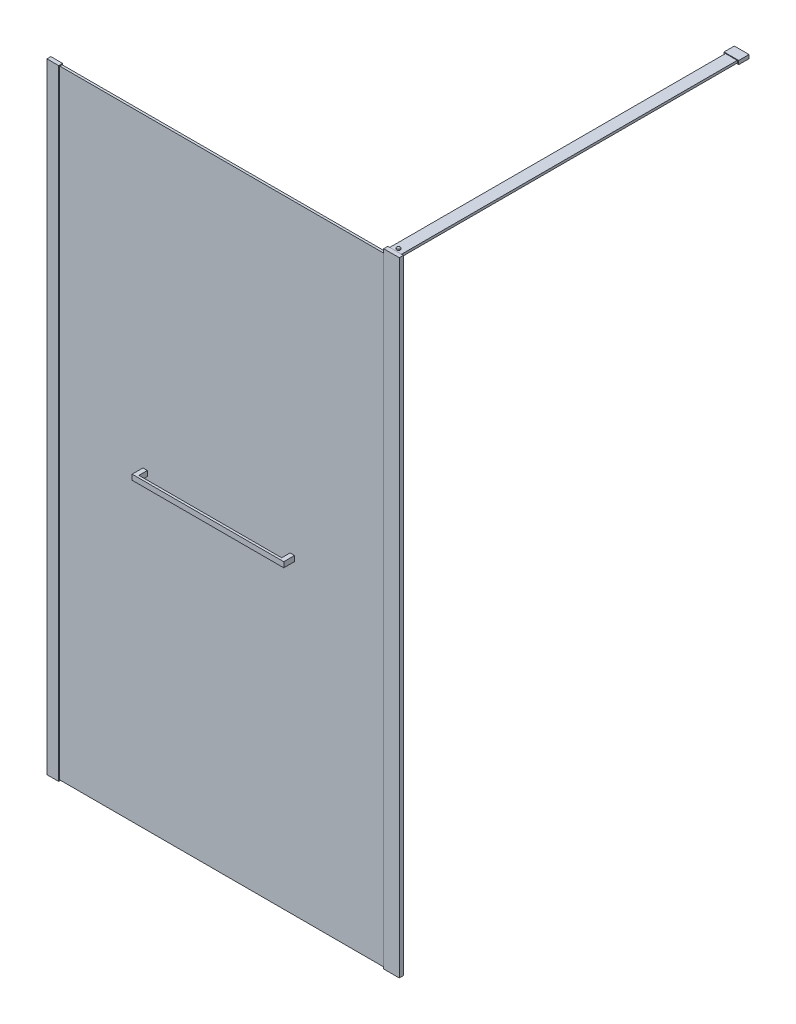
ISO-10303-21;
HEADER;
FILE_DESCRIPTION(('STEP AP214'),'2;1');
FILE_NAME('part.step','',(''),(''),'','','');
FILE_SCHEMA(('AUTOMOTIVE_DESIGN { 1 0 10303 214 1 1 1 1 }'));
ENDSEC;
DATA;
#1=APPLICATION_CONTEXT('core data for automotive mechanical design processes');
#2=APPLICATION_PROTOCOL_DEFINITION('international standard','automotive_design',2000,#1);
#3=PRODUCT_CONTEXT('',#1,'mechanical');
#4=PRODUCT('Part','Part','',(#3));
#5=PRODUCT_RELATED_PRODUCT_CATEGORY('part','',(#4));
#6=PRODUCT_DEFINITION_FORMATION('','',#4);
#7=PRODUCT_DEFINITION_CONTEXT('part definition',#1,'design');
#8=PRODUCT_DEFINITION('design','',#6,#7);
#9=PRODUCT_DEFINITION_SHAPE('','',#8);
#10=(LENGTH_UNIT() NAMED_UNIT(*) SI_UNIT(.MILLI.,.METRE.));
#11=(NAMED_UNIT(*) PLANE_ANGLE_UNIT() SI_UNIT($,.RADIAN.));
#12=(NAMED_UNIT(*) SI_UNIT($,.STERADIAN.) SOLID_ANGLE_UNIT());
#13=UNCERTAINTY_MEASURE_WITH_UNIT(LENGTH_MEASURE(1.E-05),#10,'distance_accuracy_value','');
#14=(GEOMETRIC_REPRESENTATION_CONTEXT(3) GLOBAL_UNCERTAINTY_ASSIGNED_CONTEXT((#13)) GLOBAL_UNIT_ASSIGNED_CONTEXT((#10,
#11,#12)) REPRESENTATION_CONTEXT('',''));
#15=CARTESIAN_POINT('',(0.,0.,0.));
#16=DIRECTION('',(0.,0.,1.));
#17=DIRECTION('',(1.,0.,0.));
#18=AXIS2_PLACEMENT_3D('',#15,#16,#17);
#19=CARTESIAN_POINT('',(337.5,1062.,-21.4));
#20=DIRECTION('',(1.,0.,0.));
#21=DIRECTION('',(0.,0.,-1.));
#22=AXIS2_PLACEMENT_3D('',#19,#20,#21);
#23=PLANE('',#22);
#24=DIRECTION('',(0.,1.,0.));
#25=VECTOR('',#24,1.);
#26=CARTESIAN_POINT('',(337.5,1062.,25.1));
#27=LINE('',#26,#25);
#28=CARTESIAN_POINT('',(337.5,1044.,25.1));
#29=VERTEX_POINT('',#28);
#30=CARTESIAN_POINT('',(337.5,1062.,25.1));
#31=VERTEX_POINT('',#30);
#32=EDGE_CURVE('E63',#29,#31,#27,.T.);
#33=ORIENTED_EDGE('',*,*,#32,.F.);
#34=DIRECTION('',(0.,0.,1.));
#35=VECTOR('',#34,1.);
#36=CARTESIAN_POINT('',(337.5,1044.,-21.4));
#37=LINE('',#36,#35);
#38=CARTESIAN_POINT('',(337.5,1044.,-21.4));
#39=VERTEX_POINT('',#38);
#40=EDGE_CURVE('E12',#39,#29,#37,.T.);
#41=ORIENTED_EDGE('',*,*,#40,.F.);
#42=DIRECTION('',(0.,1.,0.));
#43=VECTOR('',#42,1.);
#44=CARTESIAN_POINT('',(337.5,1062.,-21.4));
#45=LINE('',#44,#43);
#46=CARTESIAN_POINT('',(337.5,1062.,-21.4));
#47=VERTEX_POINT('',#46);
#48=EDGE_CURVE('E193',#39,#47,#45,.T.);
#49=ORIENTED_EDGE('',*,*,#48,.T.);
#50=DIRECTION('',(0.,0.,1.));
#51=VECTOR('',#50,1.);
#52=CARTESIAN_POINT('',(337.5,1062.,-21.4));
#53=LINE('',#52,#51);
#54=EDGE_CURVE('E176',#47,#31,#53,.T.);
#55=ORIENTED_EDGE('',*,*,#54,.T.);
#56=EDGE_LOOP('',(#33,#41,#49,#55));
#57=FACE_BOUND('',#56,.T.);
#58=ADVANCED_FACE('F46',(#57),#23,.T.);
#59=CARTESIAN_POINT('',(322.5,1044.,-21.4));
#60=DIRECTION('',(0.,-1.,0.));
#61=DIRECTION('',(0.,0.,-1.));
#62=AXIS2_PLACEMENT_3D('',#59,#60,#61);
#63=PLANE('',#62);
#64=ORIENTED_EDGE('',*,*,#40,.T.);
#65=DIRECTION('',(-1.,0.,0.));
#66=VECTOR('',#65,1.);
#67=CARTESIAN_POINT('',(842.197715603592,1044.,25.1));
#68=LINE('',#67,#66);
#69=CARTESIAN_POINT('',(822.5,1044.,25.1));
#70=VERTEX_POINT('',#69);
#71=EDGE_CURVE('E166',#70,#29,#68,.T.);
#72=ORIENTED_EDGE('',*,*,#71,.F.);
#73=DIRECTION('',(0.,0.,1.));
#74=VECTOR('',#73,1.);
#75=CARTESIAN_POINT('',(822.5,1044.,-21.4));
#76=LINE('',#75,#74);
#77=CARTESIAN_POINT('',(822.5,1044.,-21.4));
#78=VERTEX_POINT('',#77);
#79=EDGE_CURVE('E149',#78,#70,#76,.T.);
#80=ORIENTED_EDGE('',*,*,#79,.F.);
#81=DIRECTION('',(1.,0.,0.));
#82=VECTOR('',#81,1.);
#83=CARTESIAN_POINT('',(822.5,1044.,-21.4));
#84=LINE('',#83,#82);
#85=CARTESIAN_POINT('',(837.5,1044.,-21.4));
#86=VERTEX_POINT('',#85);
#87=EDGE_CURVE('E131',#78,#86,#84,.T.);
#88=ORIENTED_EDGE('',*,*,#87,.T.);
#89=DIRECTION('',(0.,0.,1.));
#90=VECTOR('',#89,1.);
#91=CARTESIAN_POINT('',(837.5,1044.,-21.4));
#92=LINE('',#91,#90);
#93=CARTESIAN_POINT('',(837.5,1044.,33.1));
#94=VERTEX_POINT('',#93);
#95=EDGE_CURVE('E147',#86,#94,#92,.T.);
#96=ORIENTED_EDGE('',*,*,#95,.T.);
#97=DIRECTION('',(1.,0.,0.));
#98=VECTOR('',#97,1.);
#99=CARTESIAN_POINT('',(322.5,1044.,33.1));
#100=LINE('',#99,#98);
#101=CARTESIAN_POINT('',(322.5,1044.,33.1));
#102=VERTEX_POINT('',#101);
#103=EDGE_CURVE('E135',#102,#94,#100,.T.);
#104=ORIENTED_EDGE('',*,*,#103,.F.);
#105=DIRECTION('',(0.,0.,1.));
#106=VECTOR('',#105,1.);
#107=CARTESIAN_POINT('',(322.5,1044.,-21.4));
#108=LINE('',#107,#106);
#109=CARTESIAN_POINT('',(322.5,1044.,-21.4));
#110=VERTEX_POINT('',#109);
#111=EDGE_CURVE('E55',#110,#102,#108,.T.);
#112=ORIENTED_EDGE('',*,*,#111,.F.);
#113=DIRECTION('',(1.,0.,0.));
#114=VECTOR('',#113,1.);
#115=CARTESIAN_POINT('',(322.5,1044.,-21.4));
#116=LINE('',#115,#114);
#117=EDGE_CURVE('E181',#110,#39,#116,.T.);
#118=ORIENTED_EDGE('',*,*,#117,.T.);
#119=EDGE_LOOP('',(#64,#72,#80,#88,#96,#104,#112,#118));
#120=FACE_BOUND('',#119,.T.);
#121=ADVANCED_FACE('F197',(#120),#63,.T.);
#122=CARTESIAN_POINT('',(322.5,1062.,-21.4));
#123=DIRECTION('',(-1.,0.,0.));
#124=DIRECTION('',(0.,0.,1.));
#125=AXIS2_PLACEMENT_3D('',#122,#123,#124);
#126=PLANE('',#125);
#127=ORIENTED_EDGE('',*,*,#111,.T.);
#128=DIRECTION('',(0.,-1.,0.));
#129=VECTOR('',#128,1.);
#130=CARTESIAN_POINT('',(322.5,1062.,33.1));
#131=LINE('',#130,#129);
#132=CARTESIAN_POINT('',(322.5,1062.,33.1));
#133=VERTEX_POINT('',#132);
#134=EDGE_CURVE('E121',#133,#102,#131,.T.);
#135=ORIENTED_EDGE('',*,*,#134,.F.);
#136=DIRECTION('',(0.,0.,1.));
#137=VECTOR('',#136,1.);
#138=CARTESIAN_POINT('',(322.5,1062.,-21.4));
#139=LINE('',#138,#137);
#140=CARTESIAN_POINT('',(322.5,1062.,-21.4));
#141=VERTEX_POINT('',#140);
#142=EDGE_CURVE('E116',#141,#133,#139,.T.);
#143=ORIENTED_EDGE('',*,*,#142,.F.);
#144=DIRECTION('',(0.,-1.,0.));
#145=VECTOR('',#144,1.);
#146=CARTESIAN_POINT('',(322.5,1062.,-21.4));
#147=LINE('',#146,#145);
#148=EDGE_CURVE('E186',#141,#110,#147,.T.);
#149=ORIENTED_EDGE('',*,*,#148,.T.);
#150=EDGE_LOOP('',(#127,#135,#143,#149));
#151=FACE_BOUND('',#150,.T.);
#152=ADVANCED_FACE('F218',(#151),#126,.T.);
#153=CARTESIAN_POINT('',(322.5,1062.,-21.4));
#154=DIRECTION('',(0.,1.,0.));
#155=DIRECTION('',(0.,0.,1.));
#156=AXIS2_PLACEMENT_3D('',#153,#154,#155);
#157=PLANE('',#156);
#158=ORIENTED_EDGE('',*,*,#142,.T.);
#159=DIRECTION('',(-1.,0.,0.));
#160=VECTOR('',#159,1.);
#161=CARTESIAN_POINT('',(322.5,1062.,33.1));
#162=LINE('',#161,#160);
#163=CARTESIAN_POINT('',(837.5,1062.,33.1));
#164=VERTEX_POINT('',#163);
#165=EDGE_CURVE('E109',#164,#133,#162,.T.);
#166=ORIENTED_EDGE('',*,*,#165,.F.);
#167=DIRECTION('',(0.,0.,1.));
#168=VECTOR('',#167,1.);
#169=CARTESIAN_POINT('',(837.5,1062.,-21.4));
#170=LINE('',#169,#168);
#171=CARTESIAN_POINT('',(837.5,1062.,-21.4));
#172=VERTEX_POINT('',#171);
#173=EDGE_CURVE('E113',#172,#164,#170,.T.);
#174=ORIENTED_EDGE('',*,*,#173,.F.);
#175=DIRECTION('',(-1.,0.,0.));
#176=VECTOR('',#175,1.);
#177=CARTESIAN_POINT('',(822.5,1062.,-21.4));
#178=LINE('',#177,#176);
#179=CARTESIAN_POINT('',(822.5,1062.,-21.4));
#180=VERTEX_POINT('',#179);
#181=EDGE_CURVE('E138',#172,#180,#178,.T.);
#182=ORIENTED_EDGE('',*,*,#181,.T.);
#183=DIRECTION('',(0.,0.,1.));
#184=VECTOR('',#183,1.);
#185=CARTESIAN_POINT('',(822.5,1062.,-21.4));
#186=LINE('',#185,#184);
#187=CARTESIAN_POINT('',(822.5,1062.,25.1));
#188=VERTEX_POINT('',#187);
#189=EDGE_CURVE('E130',#180,#188,#186,.T.);
#190=ORIENTED_EDGE('',*,*,#189,.T.);
#191=DIRECTION('',(-1.,0.,0.));
#192=VECTOR('',#191,1.);
#193=CARTESIAN_POINT('',(842.197715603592,1062.,25.1));
#194=LINE('',#193,#192);
#195=EDGE_CURVE('E163',#188,#31,#194,.T.);
#196=ORIENTED_EDGE('',*,*,#195,.T.);
#197=ORIENTED_EDGE('',*,*,#54,.F.);
#198=DIRECTION('',(-1.,0.,0.));
#199=VECTOR('',#198,1.);
#200=CARTESIAN_POINT('',(322.5,1062.,-21.4));
#201=LINE('',#200,#199);
#202=EDGE_CURVE('E190',#47,#141,#201,.T.);
#203=ORIENTED_EDGE('',*,*,#202,.T.);
#204=EDGE_LOOP('',(#158,#166,#174,#182,#190,#196,#197,#203));
#205=FACE_BOUND('',#204,.T.);
#206=ADVANCED_FACE('F111',(#205),#157,.T.);
#207=CARTESIAN_POINT('',(337.5,1044.,-21.4));
#208=DIRECTION('',(0.,0.,1.));
#209=DIRECTION('',(1.,0.,0.));
#210=AXIS2_PLACEMENT_3D('',#207,#208,#209);
#211=PLANE('',#210);
#212=ORIENTED_EDGE('',*,*,#48,.F.);
#213=ORIENTED_EDGE('',*,*,#117,.F.);
#214=ORIENTED_EDGE('',*,*,#148,.F.);
#215=ORIENTED_EDGE('',*,*,#202,.F.);
#216=EDGE_LOOP('',(#212,#213,#214,#215));
#217=FACE_BOUND('',#216,.T.);
#218=ADVANCED_FACE('F225',(#217),#211,.F.);
#219=CARTESIAN_POINT('',(337.5,1044.,33.1));
#220=DIRECTION('',(0.,0.,1.));
#221=DIRECTION('',(1.,0.,0.));
#222=AXIS2_PLACEMENT_3D('',#219,#220,#221);
#223=PLANE('',#222);
#224=ORIENTED_EDGE('',*,*,#103,.T.);
#225=DIRECTION('',(0.,1.,0.));
#226=VECTOR('',#225,1.);
#227=CARTESIAN_POINT('',(837.5,1062.,33.1));
#228=LINE('',#227,#226);
#229=EDGE_CURVE('E127',#94,#164,#228,.T.);
#230=ORIENTED_EDGE('',*,*,#229,.T.);
#231=ORIENTED_EDGE('',*,*,#165,.T.);
#232=ORIENTED_EDGE('',*,*,#134,.T.);
#233=EDGE_LOOP('',(#224,#230,#231,#232));
#234=FACE_BOUND('',#233,.T.);
#235=ADVANCED_FACE('F133',(#234),#223,.T.);
#236=CARTESIAN_POINT('',(842.197715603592,1062.,25.1));
#237=DIRECTION('',(0.,0.,1.));
#238=DIRECTION('',(1.,0.,0.));
#239=AXIS2_PLACEMENT_3D('',#236,#237,#238);
#240=PLANE('',#239);
#241=ORIENTED_EDGE('',*,*,#195,.F.);
#242=DIRECTION('',(0.,-1.,0.));
#243=VECTOR('',#242,1.);
#244=CARTESIAN_POINT('',(822.5,1062.,25.1));
#245=LINE('',#244,#243);
#246=EDGE_CURVE('E49',#188,#70,#245,.T.);
#247=ORIENTED_EDGE('',*,*,#246,.T.);
#248=ORIENTED_EDGE('',*,*,#71,.T.);
#249=ORIENTED_EDGE('',*,*,#32,.T.);
#250=EDGE_LOOP('',(#241,#247,#248,#249));
#251=FACE_BOUND('',#250,.T.);
#252=ADVANCED_FACE('F203',(#251),#240,.F.);
#253=CARTESIAN_POINT('',(822.5,1062.,-21.4));
#254=DIRECTION('',(-1.,0.,0.));
#255=DIRECTION('',(0.,0.,1.));
#256=AXIS2_PLACEMENT_3D('',#253,#254,#255);
#257=PLANE('',#256);
#258=ORIENTED_EDGE('',*,*,#246,.F.);
#259=ORIENTED_EDGE('',*,*,#189,.F.);
#260=DIRECTION('',(0.,-1.,0.));
#261=VECTOR('',#260,1.);
#262=CARTESIAN_POINT('',(822.5,1062.,-21.4));
#263=LINE('',#262,#261);
#264=EDGE_CURVE('E142',#180,#78,#263,.T.);
#265=ORIENTED_EDGE('',*,*,#264,.T.);
#266=ORIENTED_EDGE('',*,*,#79,.T.);
#267=EDGE_LOOP('',(#258,#259,#265,#266));
#268=FACE_BOUND('',#267,.T.);
#269=ADVANCED_FACE('F204',(#268),#257,.T.);
#270=CARTESIAN_POINT('',(837.5,1062.,-21.4));
#271=DIRECTION('',(1.,0.,0.));
#272=DIRECTION('',(0.,0.,-1.));
#273=AXIS2_PLACEMENT_3D('',#270,#271,#272);
#274=PLANE('',#273);
#275=ORIENTED_EDGE('',*,*,#173,.T.);
#276=ORIENTED_EDGE('',*,*,#229,.F.);
#277=ORIENTED_EDGE('',*,*,#95,.F.);
#278=DIRECTION('',(0.,1.,0.));
#279=VECTOR('',#278,1.);
#280=CARTESIAN_POINT('',(837.5,1062.,-21.4));
#281=LINE('',#280,#279);
#282=EDGE_CURVE('E129',#86,#172,#281,.T.);
#283=ORIENTED_EDGE('',*,*,#282,.T.);
#284=EDGE_LOOP('',(#275,#276,#277,#283));
#285=FACE_BOUND('',#284,.T.);
#286=ADVANCED_FACE('F126',(#285),#274,.T.);
#287=CARTESIAN_POINT('',(837.5,1044.,-21.4));
#288=DIRECTION('',(0.,0.,1.));
#289=DIRECTION('',(1.,0.,0.));
#290=AXIS2_PLACEMENT_3D('',#287,#288,#289);
#291=PLANE('',#290);
#292=ORIENTED_EDGE('',*,*,#282,.F.);
#293=ORIENTED_EDGE('',*,*,#87,.F.);
#294=ORIENTED_EDGE('',*,*,#264,.F.);
#295=ORIENTED_EDGE('',*,*,#181,.F.);
#296=EDGE_LOOP('',(#292,#293,#294,#295));
#297=FACE_BOUND('',#296,.T.);
#298=ADVANCED_FACE('F200',(#297),#291,.F.);
#299=CLOSED_SHELL('',(#58,#121,#152,#206,#218,#235,#252,#269,#286,#298));
#300=MANIFOLD_SOLID_BREP('B2',#299);
#301=CARTESIAN_POINT('',(1189.9,2119.,-1184.4));
#302=DIRECTION('',(-1.,0.,0.));
#303=DIRECTION('',(0.,0.,1.));
#304=AXIS2_PLACEMENT_3D('',#301,#302,#303);
#305=PLANE('',#304);
#306=DIRECTION('',(0.,-1.,0.));
#307=VECTOR('',#306,1.);
#308=CARTESIAN_POINT('',(1189.9,2119.,-1155.));
#309=LINE('',#308,#307);
#310=CARTESIAN_POINT('',(1189.9,2119.,-1155.));
#311=VERTEX_POINT('',#310);
#312=CARTESIAN_POINT('',(1189.9,2111.,-1155.));
#313=VERTEX_POINT('',#312);
#314=EDGE_CURVE('E417',#311,#313,#309,.T.);
#315=ORIENTED_EDGE('',*,*,#314,.F.);
#316=DIRECTION('',(0.,0.,1.));
#317=VECTOR('',#316,1.);
#318=CARTESIAN_POINT('',(1189.9,2119.,-1184.4));
#319=LINE('',#318,#317);
#320=CARTESIAN_POINT('',(1189.9,2119.,-14.4));
#321=VERTEX_POINT('',#320);
#322=EDGE_CURVE('E432',#311,#321,#319,.T.);
#323=ORIENTED_EDGE('',*,*,#322,.T.);
#324=DIRECTION('',(0.,-1.,0.));
#325=VECTOR('',#324,1.);
#326=CARTESIAN_POINT('',(1189.9,2119.,-14.4));
#327=LINE('',#326,#325);
#328=CARTESIAN_POINT('',(1189.9,2111.,-14.4));
#329=VERTEX_POINT('',#328);
#330=EDGE_CURVE('E420',#321,#329,#327,.T.);
#331=ORIENTED_EDGE('',*,*,#330,.T.);
#332=DIRECTION('',(0.,0.,1.));
#333=VECTOR('',#332,1.);
#334=CARTESIAN_POINT('',(1189.9,2111.,-1184.4));
#335=LINE('',#334,#333);
#336=EDGE_CURVE('E327',#313,#329,#335,.T.);
#337=ORIENTED_EDGE('',*,*,#336,.F.);
#338=EDGE_LOOP('',(#315,#323,#331,#337));
#339=FACE_BOUND('',#338,.T.);
#340=ADVANCED_FACE('F319',(#339),#305,.F.);
#341=CARTESIAN_POINT('',(1189.9,2111.,-1184.4));
#342=DIRECTION('',(0.,1.,0.));
#343=DIRECTION('',(0.,0.,1.));
#344=AXIS2_PLACEMENT_3D('',#341,#342,#343);
#345=PLANE('',#344);
#346=DIRECTION('',(-1.,0.,0.));
#347=VECTOR('',#346,1.);
#348=CARTESIAN_POINT('',(1189.9,2111.,-1155.));
#349=LINE('',#348,#347);
#350=CARTESIAN_POINT('',(1149.9,2111.,-1155.));
#351=VERTEX_POINT('',#350);
#352=EDGE_CURVE('E334',#313,#351,#349,.T.);
#353=ORIENTED_EDGE('',*,*,#352,.F.);
#354=ORIENTED_EDGE('',*,*,#336,.T.);
#355=DIRECTION('',(-1.,0.,0.));
#356=VECTOR('',#355,1.);
#357=CARTESIAN_POINT('',(1189.9,2111.,-14.4));
#358=LINE('',#357,#356);
#359=CARTESIAN_POINT('',(1149.9,2111.,-14.4));
#360=VERTEX_POINT('',#359);
#361=EDGE_CURVE('E423',#329,#360,#358,.T.);
#362=ORIENTED_EDGE('',*,*,#361,.T.);
#363=DIRECTION('',(0.,0.,1.));
#364=VECTOR('',#363,1.);
#365=CARTESIAN_POINT('',(1149.9,2111.,-1184.4));
#366=LINE('',#365,#364);
#367=EDGE_CURVE('E436',#351,#360,#366,.T.);
#368=ORIENTED_EDGE('',*,*,#367,.F.);
#369=EDGE_LOOP('',(#353,#354,#362,#368));
#370=FACE_BOUND('',#369,.T.);
#371=ADVANCED_FACE('F438',(#370),#345,.F.);
#372=CARTESIAN_POINT('',(1149.9,2119.,-1184.4));
#373=DIRECTION('',(1.,0.,0.));
#374=DIRECTION('',(0.,0.,-1.));
#375=AXIS2_PLACEMENT_3D('',#372,#373,#374);
#376=PLANE('',#375);
#377=DIRECTION('',(0.,1.,0.));
#378=VECTOR('',#377,1.);
#379=CARTESIAN_POINT('',(1149.9,2119.,-1155.));
#380=LINE('',#379,#378);
#381=CARTESIAN_POINT('',(1149.9,2119.,-1155.));
#382=VERTEX_POINT('',#381);
#383=EDGE_CURVE('E342',#351,#382,#380,.T.);
#384=ORIENTED_EDGE('',*,*,#383,.F.);
#385=ORIENTED_EDGE('',*,*,#367,.T.);
#386=DIRECTION('',(0.,1.,0.));
#387=VECTOR('',#386,1.);
#388=CARTESIAN_POINT('',(1149.9,2119.,-14.4));
#389=LINE('',#388,#387);
#390=CARTESIAN_POINT('',(1149.9,2119.,-14.4));
#391=VERTEX_POINT('',#390);
#392=EDGE_CURVE('E426',#360,#391,#389,.T.);
#393=ORIENTED_EDGE('',*,*,#392,.T.);
#394=DIRECTION('',(0.,0.,1.));
#395=VECTOR('',#394,1.);
#396=CARTESIAN_POINT('',(1149.9,2119.,-1184.4));
#397=LINE('',#396,#395);
#398=EDGE_CURVE('E434',#382,#391,#397,.T.);
#399=ORIENTED_EDGE('',*,*,#398,.F.);
#400=EDGE_LOOP('',(#384,#385,#393,#399));
#401=FACE_BOUND('',#400,.T.);
#402=ADVANCED_FACE('F448',(#401),#376,.F.);
#403=CARTESIAN_POINT('',(1189.9,2119.,-1184.4));
#404=DIRECTION('',(0.,-1.,0.));
#405=DIRECTION('',(0.,0.,-1.));
#406=AXIS2_PLACEMENT_3D('',#403,#404,#405);
#407=PLANE('',#406);
#408=CARTESIAN_POINT('',(1169.9,2119.,-24.3999999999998));
#409=DIRECTION('',(0.,-1.,0.));
#410=DIRECTION('',(0.,0.,-1.));
#411=AXIS2_PLACEMENT_3D('',#408,#409,#410);
#412=CIRCLE('',#411,5.90000000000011);
#413=CARTESIAN_POINT('',(1169.9,2119.,-30.2999999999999));
#414=VERTEX_POINT('',#413);
#415=EDGE_CURVE('E511',#414,#414,#412,.T.);
#416=ORIENTED_EDGE('',*,*,#415,.T.);
#417=EDGE_LOOP('',(#416));
#418=FACE_BOUND('',#417,.T.);
#419=DIRECTION('',(1.,0.,0.));
#420=VECTOR('',#419,1.);
#421=CARTESIAN_POINT('',(1189.9,2119.,-1155.));
#422=LINE('',#421,#420);
#423=EDGE_CURVE('E44',#382,#311,#422,.T.);
#424=ORIENTED_EDGE('',*,*,#423,.F.);
#425=ORIENTED_EDGE('',*,*,#398,.T.);
#426=DIRECTION('',(1.,0.,0.));
#427=VECTOR('',#426,1.);
#428=CARTESIAN_POINT('',(1189.9,2119.,-14.4));
#429=LINE('',#428,#427);
#430=EDGE_CURVE('E429',#391,#321,#429,.T.);
#431=ORIENTED_EDGE('',*,*,#430,.T.);
#432=ORIENTED_EDGE('',*,*,#322,.F.);
#433=EDGE_LOOP('',(#424,#425,#431,#432));
#434=FACE_BOUND('',#433,.T.);
#435=ADVANCED_FACE('F447',(#418,#434),#407,.F.);
#436=CARTESIAN_POINT('',(1189.9,2111.,-14.4));
#437=DIRECTION('',(0.,0.,-1.));
#438=DIRECTION('',(-1.,0.,0.));
#439=AXIS2_PLACEMENT_3D('',#436,#437,#438);
#440=PLANE('',#439);
#441=ORIENTED_EDGE('',*,*,#330,.F.);
#442=ORIENTED_EDGE('',*,*,#430,.F.);
#443=ORIENTED_EDGE('',*,*,#392,.F.);
#444=ORIENTED_EDGE('',*,*,#361,.F.);
#445=EDGE_LOOP('',(#441,#442,#443,#444));
#446=FACE_BOUND('',#445,.T.);
#447=ADVANCED_FACE('F444',(#446),#440,.F.);
#448=CARTESIAN_POINT('',(1144.9,2108.75,-1155.));
#449=DIRECTION('',(0.,0.,-1.));
#450=DIRECTION('',(-1.,0.,0.));
#451=AXIS2_PLACEMENT_3D('',#448,#449,#450);
#452=PLANE('',#451);
#453=DIRECTION('',(0.,1.,0.));
#454=VECTOR('',#453,1.);
#455=CARTESIAN_POINT('',(1144.9,2121.25,-1155.));
#456=LINE('',#455,#454);
#457=CARTESIAN_POINT('',(1144.9,2108.75,-1155.));
#458=VERTEX_POINT('',#457);
#459=CARTESIAN_POINT('',(1144.9,2121.25,-1155.));
#460=VERTEX_POINT('',#459);
#461=EDGE_CURVE('E409',#458,#460,#456,.T.);
#462=ORIENTED_EDGE('',*,*,#461,.F.);
#463=DIRECTION('',(-1.,0.,0.));
#464=VECTOR('',#463,1.);
#465=CARTESIAN_POINT('',(1194.9,2108.75,-1155.));
#466=LINE('',#465,#464);
#467=CARTESIAN_POINT('',(1194.9,2108.75,-1155.));
#468=VERTEX_POINT('',#467);
#469=EDGE_CURVE('E405',#468,#458,#466,.T.);
#470=ORIENTED_EDGE('',*,*,#469,.F.);
#471=DIRECTION('',(0.,-1.,0.));
#472=VECTOR('',#471,1.);
#473=CARTESIAN_POINT('',(1194.9,2121.25,-1155.));
#474=LINE('',#473,#472);
#475=CARTESIAN_POINT('',(1194.9,2121.25,-1155.));
#476=VERTEX_POINT('',#475);
#477=EDGE_CURVE('E492',#476,#468,#474,.T.);
#478=ORIENTED_EDGE('',*,*,#477,.F.);
#479=DIRECTION('',(1.,0.,0.));
#480=VECTOR('',#479,1.);
#481=CARTESIAN_POINT('',(1194.9,2121.25,-1155.));
#482=LINE('',#481,#480);
#483=EDGE_CURVE('E495',#460,#476,#482,.T.);
#484=ORIENTED_EDGE('',*,*,#483,.F.);
#485=EDGE_LOOP('',(#462,#470,#478,#484));
#486=FACE_BOUND('',#485,.T.);
#487=ORIENTED_EDGE('',*,*,#423,.T.);
#488=ORIENTED_EDGE('',*,*,#314,.T.);
#489=ORIENTED_EDGE('',*,*,#352,.T.);
#490=ORIENTED_EDGE('',*,*,#383,.T.);
#491=EDGE_LOOP('',(#487,#488,#489,#490));
#492=FACE_BOUND('',#491,.T.);
#493=ADVANCED_FACE('F450',(#486,#492),#452,.F.);
#494=CARTESIAN_POINT('',(1144.9,2121.25,-1190.));
#495=DIRECTION('',(1.,0.,0.));
#496=DIRECTION('',(0.,0.,-1.));
#497=AXIS2_PLACEMENT_3D('',#494,#495,#496);
#498=PLANE('',#497);
#499=ORIENTED_EDGE('',*,*,#461,.T.);
#500=DIRECTION('',(0.,0.,1.));
#501=VECTOR('',#500,1.);
#502=CARTESIAN_POINT('',(1144.9,2121.25,-1190.));
#503=LINE('',#502,#501);
#504=CARTESIAN_POINT('',(1144.9,2121.25,-1190.));
#505=VERTEX_POINT('',#504);
#506=EDGE_CURVE('E389',#505,#460,#503,.T.);
#507=ORIENTED_EDGE('',*,*,#506,.F.);
#508=DIRECTION('',(0.,1.,0.));
#509=VECTOR('',#508,1.);
#510=CARTESIAN_POINT('',(1144.9,2121.25,-1190.));
#511=LINE('',#510,#509);
#512=CARTESIAN_POINT('',(1144.9,2108.75,-1190.));
#513=VERTEX_POINT('',#512);
#514=EDGE_CURVE('E396',#513,#505,#511,.T.);
#515=ORIENTED_EDGE('',*,*,#514,.F.);
#516=DIRECTION('',(0.,0.,1.));
#517=VECTOR('',#516,1.);
#518=CARTESIAN_POINT('',(1144.9,2108.75,-1190.));
#519=LINE('',#518,#517);
#520=EDGE_CURVE('E489',#513,#458,#519,.T.);
#521=ORIENTED_EDGE('',*,*,#520,.T.);
#522=EDGE_LOOP('',(#499,#507,#515,#521));
#523=FACE_BOUND('',#522,.T.);
#524=ADVANCED_FACE('F407',(#523),#498,.F.);
#525=CARTESIAN_POINT('',(1194.9,2121.25,-1190.));
#526=DIRECTION('',(0.,-1.,0.));
#527=DIRECTION('',(0.,0.,-1.));
#528=AXIS2_PLACEMENT_3D('',#525,#526,#527);
#529=PLANE('',#528);
#530=ORIENTED_EDGE('',*,*,#483,.T.);
#531=DIRECTION('',(0.,0.,1.));
#532=VECTOR('',#531,1.);
#533=CARTESIAN_POINT('',(1194.9,2121.25,-1190.));
#534=LINE('',#533,#532);
#535=CARTESIAN_POINT('',(1194.9,2121.25,-1190.));
#536=VERTEX_POINT('',#535);
#537=EDGE_CURVE('E392',#536,#476,#534,.T.);
#538=ORIENTED_EDGE('',*,*,#537,.F.);
#539=DIRECTION('',(1.,0.,0.));
#540=VECTOR('',#539,1.);
#541=CARTESIAN_POINT('',(1194.9,2121.25,-1190.));
#542=LINE('',#541,#540);
#543=EDGE_CURVE('E385',#505,#536,#542,.T.);
#544=ORIENTED_EDGE('',*,*,#543,.F.);
#545=ORIENTED_EDGE('',*,*,#506,.T.);
#546=EDGE_LOOP('',(#530,#538,#544,#545));
#547=FACE_BOUND('',#546,.T.);
#548=ADVANCED_FACE('F387',(#547),#529,.F.);
#549=CARTESIAN_POINT('',(1194.9,2121.25,-1190.));
#550=DIRECTION('',(-1.,0.,0.));
#551=DIRECTION('',(0.,0.,1.));
#552=AXIS2_PLACEMENT_3D('',#549,#550,#551);
#553=PLANE('',#552);
#554=ORIENTED_EDGE('',*,*,#477,.T.);
#555=DIRECTION('',(0.,0.,1.));
#556=VECTOR('',#555,1.);
#557=CARTESIAN_POINT('',(1194.9,2108.75,-1190.));
#558=LINE('',#557,#556);
#559=CARTESIAN_POINT('',(1194.9,2108.75,-1190.));
#560=VERTEX_POINT('',#559);
#561=EDGE_CURVE('E412',#560,#468,#558,.T.);
#562=ORIENTED_EDGE('',*,*,#561,.F.);
#563=DIRECTION('',(0.,-1.,0.));
#564=VECTOR('',#563,1.);
#565=CARTESIAN_POINT('',(1194.9,2121.25,-1190.));
#566=LINE('',#565,#564);
#567=EDGE_CURVE('E395',#536,#560,#566,.T.);
#568=ORIENTED_EDGE('',*,*,#567,.F.);
#569=ORIENTED_EDGE('',*,*,#537,.T.);
#570=EDGE_LOOP('',(#554,#562,#568,#569));
#571=FACE_BOUND('',#570,.T.);
#572=ADVANCED_FACE('F477',(#571),#553,.F.);
#573=CARTESIAN_POINT('',(1194.9,2108.75,-1190.));
#574=DIRECTION('',(0.,1.,0.));
#575=DIRECTION('',(0.,0.,1.));
#576=AXIS2_PLACEMENT_3D('',#573,#574,#575);
#577=PLANE('',#576);
#578=ORIENTED_EDGE('',*,*,#469,.T.);
#579=ORIENTED_EDGE('',*,*,#520,.F.);
#580=DIRECTION('',(-1.,0.,0.));
#581=VECTOR('',#580,1.);
#582=CARTESIAN_POINT('',(1194.9,2108.75,-1190.));
#583=LINE('',#582,#581);
#584=EDGE_CURVE('E401',#560,#513,#583,.T.);
#585=ORIENTED_EDGE('',*,*,#584,.F.);
#586=ORIENTED_EDGE('',*,*,#561,.T.);
#587=EDGE_LOOP('',(#578,#579,#585,#586));
#588=FACE_BOUND('',#587,.T.);
#589=ADVANCED_FACE('F479',(#588),#577,.F.);
#590=CARTESIAN_POINT('',(1144.9,2108.75,-1190.));
#591=DIRECTION('',(0.,0.,-1.));
#592=DIRECTION('',(-1.,0.,0.));
#593=AXIS2_PLACEMENT_3D('',#590,#591,#592);
#594=PLANE('',#593);
#595=ORIENTED_EDGE('',*,*,#514,.T.);
#596=ORIENTED_EDGE('',*,*,#543,.T.);
#597=ORIENTED_EDGE('',*,*,#567,.T.);
#598=ORIENTED_EDGE('',*,*,#584,.T.);
#599=EDGE_LOOP('',(#595,#596,#597,#598));
#600=FACE_BOUND('',#599,.T.);
#601=ADVANCED_FACE('F399',(#600),#594,.T.);
#602=CARTESIAN_POINT('',(1169.9,2115.34934210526,-24.3999999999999));
#603=DIRECTION('',(0.,-1.,0.));
#604=DIRECTION('',(0.,0.,-1.));
#605=AXIS2_PLACEMENT_3D('',#602,#603,#604);
#606=SPHERICAL_SURFACE('',#605,9.35065789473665);
#607=CARTESIAN_POINT('',(1169.9,2122.8,-24.3999999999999));
#608=DIRECTION('',(0.,-1.,0.));
#609=DIRECTION('',(0.,0.,-1.));
#610=AXIS2_PLACEMENT_3D('',#607,#608,#609);
#611=CIRCLE('',#610,5.65000000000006);
#612=CARTESIAN_POINT('',(1169.9,2122.8,-30.0499999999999));
#613=VERTEX_POINT('',#612);
#614=EDGE_CURVE('E508',#613,#613,#611,.T.);
#615=ORIENTED_EDGE('',*,*,#614,.F.);
#616=EDGE_LOOP('',(#615));
#617=FACE_BOUND('',#616,.T.);
#618=ADVANCED_FACE('F486',(#617),#606,.T.);
#619=CARTESIAN_POINT('',(1169.9,2119.,-24.3999999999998));
#620=DIRECTION('',(0.,-1.,0.));
#621=DIRECTION('',(0.,0.,-1.));
#622=AXIS2_PLACEMENT_3D('',#619,#620,#621);
#623=CONICAL_SURFACE('',#622,5.90000000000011,0.0656948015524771);
#624=ORIENTED_EDGE('',*,*,#614,.T.);
#625=EDGE_LOOP('',(#624));
#626=FACE_BOUND('',#625,.T.);
#627=ORIENTED_EDGE('',*,*,#415,.F.);
#628=EDGE_LOOP('',(#627));
#629=FACE_BOUND('',#628,.T.);
#630=ADVANCED_FACE('F515',(#626,#629),#623,.T.);
#631=CLOSED_SHELL('',(#340,#371,#402,#435,#447,#493,#524,#548,#572,#589,#601,#618,#630));
#632=CARTESIAN_POINT('',(1169.9,2122.53567623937,-24.3999999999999));
#633=DIRECTION('',(0.,-1.,0.));
#634=DIRECTION('',(0.,0.,-1.));
#635=AXIS2_PLACEMENT_3D('',#632,#633,#634);
#636=CONICAL_SURFACE('',#635,5.1663088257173,0.0656948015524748);
#637=CARTESIAN_POINT('',(1169.9,2119.,-24.3999999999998));
#638=DIRECTION('',(0.,-1.,0.));
#639=DIRECTION('',(0.,0.,-1.));
#640=AXIS2_PLACEMENT_3D('',#637,#638,#639);
#641=CIRCLE('',#640,5.398919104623);
#642=CARTESIAN_POINT('',(1169.9,2119.,-29.7989191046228));
#643=VERTEX_POINT('',#642);
#644=EDGE_CURVE('E496',#643,#643,#641,.T.);
#645=ORIENTED_EDGE('',*,*,#644,.T.);
#646=EDGE_LOOP('',(#645));
#647=FACE_BOUND('',#646,.T.);
#648=CARTESIAN_POINT('',(1169.9,2122.53567623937,-24.3999999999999));
#649=DIRECTION('',(0.,-1.,0.));
#650=DIRECTION('',(0.,0.,-1.));
#651=AXIS2_PLACEMENT_3D('',#648,#649,#650);
#652=CIRCLE('',#651,5.1663088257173);
#653=CARTESIAN_POINT('',(1169.9,2122.53567623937,-29.5663088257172));
#654=VERTEX_POINT('',#653);
#655=EDGE_CURVE('E500',#654,#654,#652,.T.);
#656=ORIENTED_EDGE('',*,*,#655,.F.);
#657=EDGE_LOOP('',(#656));
#658=FACE_BOUND('',#657,.T.);
#659=ADVANCED_FACE('F529',(#647,#658),#636,.F.);
#660=CARTESIAN_POINT('',(1169.9,2115.34934210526,-24.3999999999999));
#661=DIRECTION('',(0.,-1.,0.));
#662=DIRECTION('',(0.,0.,1.));
#663=AXIS2_PLACEMENT_3D('',#660,#661,#662);
#664=SPHERICAL_SURFACE('',#663,8.85065789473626);
#665=ORIENTED_EDGE('',*,*,#655,.T.);
#666=EDGE_LOOP('',(#665));
#667=FACE_BOUND('',#666,.T.);
#668=ADVANCED_FACE('F526',(#667),#664,.F.);
#669=ORIENTED_EDGE('',*,*,#644,.F.);
#670=EDGE_LOOP('',(#669));
#671=FACE_BOUND('',#670,.T.);
#672=ADVANCED_FACE('F473',(#671),#407,.F.);
#673=CLOSED_SHELL('',(#659,#668,#672));
#674=ORIENTED_CLOSED_SHELL('',*,#673,.T.);
#675=BREP_WITH_VOIDS('B6',#631,(#674));
#676=CARTESIAN_POINT('',(1196.4,2111.,-0.399999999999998));
#677=DIRECTION('',(0.,-1.,0.));
#678=DIRECTION('',(0.,0.,-1.));
#679=AXIS2_PLACEMENT_3D('',#676,#677,#678);
#680=PLANE('',#679);
#681=DIRECTION('',(-1.,0.,0.));
#682=VECTOR('',#681,1.);
#683=CARTESIAN_POINT('',(1143.4,2111.,-11.4));
#684=LINE('',#683,#682);
#685=CARTESIAN_POINT('',(1144.7,2111.,-11.4));
#686=VERTEX_POINT('',#685);
#687=CARTESIAN_POINT('',(1143.4,2111.,-11.4));
#688=VERTEX_POINT('',#687);
#689=EDGE_CURVE('E781',#686,#688,#684,.T.);
#690=ORIENTED_EDGE('',*,*,#689,.F.);
#691=DIRECTION('',(0.,0.,1.));
#692=VECTOR('',#691,1.);
#693=CARTESIAN_POINT('',(1144.7,2111.,-0.399999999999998));
#694=LINE('',#693,#692);
#695=CARTESIAN_POINT('',(1144.7,2111.,-3.39999999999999));
#696=VERTEX_POINT('',#695);
#697=EDGE_CURVE('E647',#686,#696,#694,.T.);
#698=ORIENTED_EDGE('',*,*,#697,.T.);
#699=DIRECTION('',(1.,0.,0.));
#700=VECTOR('',#699,1.);
#701=CARTESIAN_POINT('',(1153.5,2111.,-3.39999999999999));
#702=LINE('',#701,#700);
#703=CARTESIAN_POINT('',(1143.4,2111.,-3.39999999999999));
#704=VERTEX_POINT('',#703);
#705=EDGE_CURVE('E785',#704,#696,#702,.T.);
#706=ORIENTED_EDGE('',*,*,#705,.F.);
#707=DIRECTION('',(0.,0.,1.));
#708=VECTOR('',#707,1.);
#709=CARTESIAN_POINT('',(1143.4,2111.,-14.4));
#710=LINE('',#709,#708);
#711=EDGE_CURVE('E762',#688,#704,#710,.T.);
#712=ORIENTED_EDGE('',*,*,#711,.F.);
#713=EDGE_LOOP('',(#690,#698,#706,#712));
#714=FACE_BOUND('',#713,.T.);
#715=ADVANCED_FACE('F638',(#714),#680,.T.);
#716=CARTESIAN_POINT('',(1153.5,2111.,-3.39999999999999));
#717=DIRECTION('',(0.,0.,-1.));
#718=DIRECTION('',(-1.,0.,0.));
#719=AXIS2_PLACEMENT_3D('',#716,#717,#718);
#720=PLANE('',#719);
#721=DIRECTION('',(-1.,0.,0.));
#722=VECTOR('',#721,1.);
#723=CARTESIAN_POINT('',(1153.5,2103.2,-3.39999999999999));
#724=LINE('',#723,#722);
#725=CARTESIAN_POINT('',(1153.5,2103.2,-3.39999999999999));
#726=VERTEX_POINT('',#725);
#727=CARTESIAN_POINT('',(1144.7,2103.2,-3.39999999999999));
#728=VERTEX_POINT('',#727);
#729=EDGE_CURVE('E760',#726,#728,#724,.T.);
#730=ORIENTED_EDGE('',*,*,#729,.F.);
#731=DIRECTION('',(0.,-1.,0.));
#732=VECTOR('',#731,1.);
#733=CARTESIAN_POINT('',(1153.5,2111.,-3.39999999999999));
#734=LINE('',#733,#732);
#735=CARTESIAN_POINT('',(1153.5,3.,-3.39999999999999));
#736=VERTEX_POINT('',#735);
#737=EDGE_CURVE('E784',#726,#736,#734,.T.);
#738=ORIENTED_EDGE('',*,*,#737,.T.);
#739=DIRECTION('',(1.,0.,0.));
#740=VECTOR('',#739,1.);
#741=CARTESIAN_POINT('',(1153.5,3.,-3.39999999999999));
#742=LINE('',#741,#740);
#743=CARTESIAN_POINT('',(1143.4,3.,-3.39999999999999));
#744=VERTEX_POINT('',#743);
#745=EDGE_CURVE('E772',#744,#736,#742,.T.);
#746=ORIENTED_EDGE('',*,*,#745,.F.);
#747=DIRECTION('',(0.,-1.,0.));
#748=VECTOR('',#747,1.);
#749=CARTESIAN_POINT('',(1143.4,2111.,-3.39999999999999));
#750=LINE('',#749,#748);
#751=EDGE_CURVE('E663',#704,#744,#750,.T.);
#752=ORIENTED_EDGE('',*,*,#751,.F.);
#753=ORIENTED_EDGE('',*,*,#705,.T.);
#754=DIRECTION('',(0.,-1.,0.));
#755=VECTOR('',#754,1.);
#756=CARTESIAN_POINT('',(1144.7,2111.,-3.39999999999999));
#757=LINE('',#756,#755);
#758=EDGE_CURVE('E655',#696,#728,#757,.T.);
#759=ORIENTED_EDGE('',*,*,#758,.T.);
#760=EDGE_LOOP('',(#730,#738,#746,#752,#753,#759));
#761=FACE_BOUND('',#760,.T.);
#762=ADVANCED_FACE('F640',(#761),#720,.T.);
#763=CARTESIAN_POINT('',(1143.4,2111.,-3.39999999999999));
#764=DIRECTION('',(-1.,0.,0.));
#765=DIRECTION('',(0.,0.,1.));
#766=AXIS2_PLACEMENT_3D('',#763,#764,#765);
#767=PLANE('',#766);
#768=DIRECTION('',(0.,-1.,0.));
#769=VECTOR('',#768,1.);
#770=CARTESIAN_POINT('',(1143.4,2111.,-14.4));
#771=LINE('',#770,#769);
#772=CARTESIAN_POINT('',(1143.4,2119.,-14.4));
#773=VERTEX_POINT('',#772);
#774=CARTESIAN_POINT('',(1143.4,0.,-14.4));
#775=VERTEX_POINT('',#774);
#776=EDGE_CURVE('E719',#773,#775,#771,.T.);
#777=ORIENTED_EDGE('',*,*,#776,.T.);
#778=DIRECTION('',(0.,0.,-1.));
#779=VECTOR('',#778,1.);
#780=CARTESIAN_POINT('',(1143.4,0.,-0.399999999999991));
#781=LINE('',#780,#779);
#782=CARTESIAN_POINT('',(1143.4,0.,-0.399999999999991));
#783=VERTEX_POINT('',#782);
#784=EDGE_CURVE('E723',#783,#775,#781,.T.);
#785=ORIENTED_EDGE('',*,*,#784,.F.);
#786=DIRECTION('',(0.,-1.,0.));
#787=VECTOR('',#786,1.);
#788=CARTESIAN_POINT('',(1143.4,2111.,-0.399999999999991));
#789=LINE('',#788,#787);
#790=CARTESIAN_POINT('',(1143.4,2119.,-0.399999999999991));
#791=VERTEX_POINT('',#790);
#792=EDGE_CURVE('E793',#791,#783,#789,.T.);
#793=ORIENTED_EDGE('',*,*,#792,.F.);
#794=DIRECTION('',(0.,0.,1.));
#795=VECTOR('',#794,1.);
#796=CARTESIAN_POINT('',(1143.4,2119.,-14.4));
#797=LINE('',#796,#795);
#798=EDGE_CURVE('E725',#773,#791,#797,.T.);
#799=ORIENTED_EDGE('',*,*,#798,.F.);
#800=EDGE_LOOP('',(#777,#785,#793,#799));
#801=FACE_BOUND('',#800,.T.);
#802=ORIENTED_EDGE('',*,*,#751,.T.);
#803=DIRECTION('',(0.,0.,-1.));
#804=VECTOR('',#803,1.);
#805=CARTESIAN_POINT('',(1143.4,3.,-0.399999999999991));
#806=LINE('',#805,#804);
#807=CARTESIAN_POINT('',(1143.4,3.,-11.4));
#808=VERTEX_POINT('',#807);
#809=EDGE_CURVE('E744',#744,#808,#806,.T.);
#810=ORIENTED_EDGE('',*,*,#809,.T.);
#811=DIRECTION('',(0.,-1.,0.));
#812=VECTOR('',#811,1.);
#813=CARTESIAN_POINT('',(1143.4,2111.,-11.4));
#814=LINE('',#813,#812);
#815=EDGE_CURVE('E730',#688,#808,#814,.T.);
#816=ORIENTED_EDGE('',*,*,#815,.F.);
#817=ORIENTED_EDGE('',*,*,#711,.T.);
#818=EDGE_LOOP('',(#802,#810,#816,#817));
#819=FACE_BOUND('',#818,.T.);
#820=ADVANCED_FACE('F721',(#801,#819),#767,.T.);
#821=CARTESIAN_POINT('',(1143.4,2111.,-0.399999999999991));
#822=DIRECTION('',(0.,0.,1.));
#823=DIRECTION('',(1.,0.,0.));
#824=AXIS2_PLACEMENT_3D('',#821,#822,#823);
#825=PLANE('',#824);
#826=ORIENTED_EDGE('',*,*,#792,.T.);
#827=DIRECTION('',(-1.,0.,0.));
#828=VECTOR('',#827,1.);
#829=CARTESIAN_POINT('',(1143.4,0.,-0.399999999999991));
#830=LINE('',#829,#828);
#831=CARTESIAN_POINT('',(1196.4,0.,-0.399999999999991));
#832=VERTEX_POINT('',#831);
#833=EDGE_CURVE('E743',#832,#783,#830,.T.);
#834=ORIENTED_EDGE('',*,*,#833,.F.);
#835=DIRECTION('',(0.,-1.,0.));
#836=VECTOR('',#835,1.);
#837=CARTESIAN_POINT('',(1196.4,2111.,-0.399999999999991));
#838=LINE('',#837,#836);
#839=CARTESIAN_POINT('',(1196.4,2119.,-0.399999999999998));
#840=VERTEX_POINT('',#839);
#841=EDGE_CURVE('E795',#840,#832,#838,.T.);
#842=ORIENTED_EDGE('',*,*,#841,.F.);
#843=DIRECTION('',(1.,0.,0.));
#844=VECTOR('',#843,1.);
#845=CARTESIAN_POINT('',(1196.4,2119.,-0.399999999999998));
#846=LINE('',#845,#844);
#847=EDGE_CURVE('E769',#791,#840,#846,.T.);
#848=ORIENTED_EDGE('',*,*,#847,.F.);
#849=EDGE_LOOP('',(#826,#834,#842,#848));
#850=FACE_BOUND('',#849,.T.);
#851=ADVANCED_FACE('F822',(#850),#825,.T.);
#852=CARTESIAN_POINT('',(1196.4,2111.,-0.399999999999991));
#853=DIRECTION('',(1.,0.,0.));
#854=DIRECTION('',(0.,0.,-1.));
#855=AXIS2_PLACEMENT_3D('',#852,#853,#854);
#856=PLANE('',#855);
#857=ORIENTED_EDGE('',*,*,#841,.T.);
#858=DIRECTION('',(0.,0.,1.));
#859=VECTOR('',#858,1.);
#860=CARTESIAN_POINT('',(1196.4,0.,-0.399999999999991));
#861=LINE('',#860,#859);
#862=CARTESIAN_POINT('',(1196.4,0.,-14.4));
#863=VERTEX_POINT('',#862);
#864=EDGE_CURVE('E738',#863,#832,#861,.T.);
#865=ORIENTED_EDGE('',*,*,#864,.F.);
#866=DIRECTION('',(0.,-1.,0.));
#867=VECTOR('',#866,1.);
#868=CARTESIAN_POINT('',(1196.4,2111.,-14.4));
#869=LINE('',#868,#867);
#870=CARTESIAN_POINT('',(1196.4,2119.,-14.4));
#871=VERTEX_POINT('',#870);
#872=EDGE_CURVE('E729',#871,#863,#869,.T.);
#873=ORIENTED_EDGE('',*,*,#872,.F.);
#874=DIRECTION('',(0.,0.,-1.));
#875=VECTOR('',#874,1.);
#876=CARTESIAN_POINT('',(1196.4,2119.,-14.4));
#877=LINE('',#876,#875);
#878=EDGE_CURVE('E763',#840,#871,#877,.T.);
#879=ORIENTED_EDGE('',*,*,#878,.F.);
#880=EDGE_LOOP('',(#857,#865,#873,#879));
#881=FACE_BOUND('',#880,.T.);
#882=ADVANCED_FACE('F828',(#881),#856,.T.);
#883=CARTESIAN_POINT('',(1196.4,2111.,-14.4));
#884=DIRECTION('',(0.,0.,-1.));
#885=DIRECTION('',(-1.,0.,0.));
#886=AXIS2_PLACEMENT_3D('',#883,#884,#885);
#887=PLANE('',#886);
#888=ORIENTED_EDGE('',*,*,#872,.T.);
#889=DIRECTION('',(1.,0.,0.));
#890=VECTOR('',#889,1.);
#891=CARTESIAN_POINT('',(1143.4,0.,-14.4));
#892=LINE('',#891,#890);
#893=EDGE_CURVE('E733',#775,#863,#892,.T.);
#894=ORIENTED_EDGE('',*,*,#893,.F.);
#895=ORIENTED_EDGE('',*,*,#776,.F.);
#896=DIRECTION('',(-1.,0.,0.));
#897=VECTOR('',#896,1.);
#898=CARTESIAN_POINT('',(1196.4,2119.,-14.4));
#899=LINE('',#898,#897);
#900=EDGE_CURVE('E766',#871,#773,#899,.T.);
#901=ORIENTED_EDGE('',*,*,#900,.F.);
#902=EDGE_LOOP('',(#888,#894,#895,#901));
#903=FACE_BOUND('',#902,.T.);
#904=ADVANCED_FACE('F734',(#903),#887,.T.);
#905=CARTESIAN_POINT('',(1143.4,2111.,-11.4));
#906=DIRECTION('',(0.,0.,1.));
#907=DIRECTION('',(1.,0.,0.));
#908=AXIS2_PLACEMENT_3D('',#905,#906,#907);
#909=PLANE('',#908);
#910=DIRECTION('',(1.,0.,0.));
#911=VECTOR('',#910,1.);
#912=CARTESIAN_POINT('',(1143.4,2103.2,-11.4));
#913=LINE('',#912,#911);
#914=CARTESIAN_POINT('',(1144.7,2103.2,-11.4));
#915=VERTEX_POINT('',#914);
#916=CARTESIAN_POINT('',(1153.5,2103.2,-11.4));
#917=VERTEX_POINT('',#916);
#918=EDGE_CURVE('E758',#915,#917,#913,.T.);
#919=ORIENTED_EDGE('',*,*,#918,.F.);
#920=DIRECTION('',(0.,1.,0.));
#921=VECTOR('',#920,1.);
#922=CARTESIAN_POINT('',(1144.7,2111.,-11.4));
#923=LINE('',#922,#921);
#924=EDGE_CURVE('E754',#915,#686,#923,.T.);
#925=ORIENTED_EDGE('',*,*,#924,.T.);
#926=ORIENTED_EDGE('',*,*,#689,.T.);
#927=ORIENTED_EDGE('',*,*,#815,.T.);
#928=DIRECTION('',(-1.,0.,0.));
#929=VECTOR('',#928,1.);
#930=CARTESIAN_POINT('',(1143.4,3.,-11.4));
#931=LINE('',#930,#929);
#932=CARTESIAN_POINT('',(1153.5,3.,-11.4));
#933=VERTEX_POINT('',#932);
#934=EDGE_CURVE('E789',#933,#808,#931,.T.);
#935=ORIENTED_EDGE('',*,*,#934,.F.);
#936=DIRECTION('',(0.,-1.,0.));
#937=VECTOR('',#936,1.);
#938=CARTESIAN_POINT('',(1153.5,2111.,-11.4));
#939=LINE('',#938,#937);
#940=EDGE_CURVE('E798',#917,#933,#939,.T.);
#941=ORIENTED_EDGE('',*,*,#940,.F.);
#942=EDGE_LOOP('',(#919,#925,#926,#927,#935,#941));
#943=FACE_BOUND('',#942,.T.);
#944=ADVANCED_FACE('F811',(#943),#909,.T.);
#945=CARTESIAN_POINT('',(1153.5,2111.,-11.4));
#946=DIRECTION('',(-1.,0.,0.));
#947=DIRECTION('',(0.,0.,1.));
#948=AXIS2_PLACEMENT_3D('',#945,#946,#947);
#949=PLANE('',#948);
#950=DIRECTION('',(0.,0.,1.));
#951=VECTOR('',#950,1.);
#952=CARTESIAN_POINT('',(1153.5,2103.2,-11.4));
#953=LINE('',#952,#951);
#954=EDGE_CURVE('E316',#917,#726,#953,.T.);
#955=ORIENTED_EDGE('',*,*,#954,.F.);
#956=ORIENTED_EDGE('',*,*,#940,.T.);
#957=DIRECTION('',(0.,0.,-1.));
#958=VECTOR('',#957,1.);
#959=CARTESIAN_POINT('',(1153.5,3.,-11.4));
#960=LINE('',#959,#958);
#961=EDGE_CURVE('E778',#736,#933,#960,.T.);
#962=ORIENTED_EDGE('',*,*,#961,.F.);
#963=ORIENTED_EDGE('',*,*,#737,.F.);
#964=EDGE_LOOP('',(#955,#956,#962,#963));
#965=FACE_BOUND('',#964,.T.);
#966=ADVANCED_FACE('F842',(#965),#949,.T.);
#967=CARTESIAN_POINT('',(1196.4,2119.,-0.399999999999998));
#968=DIRECTION('',(0.,-1.,0.));
#969=DIRECTION('',(0.,0.,-1.));
#970=AXIS2_PLACEMENT_3D('',#967,#968,#969);
#971=PLANE('',#970);
#972=ORIENTED_EDGE('',*,*,#878,.T.);
#973=ORIENTED_EDGE('',*,*,#900,.T.);
#974=ORIENTED_EDGE('',*,*,#798,.T.);
#975=ORIENTED_EDGE('',*,*,#847,.T.);
#976=EDGE_LOOP('',(#972,#973,#974,#975));
#977=FACE_BOUND('',#976,.T.);
#978=ADVANCED_FACE('F838',(#977),#971,.F.);
#979=CARTESIAN_POINT('',(1159.7,2103.2,-3.34999999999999));
#980=DIRECTION('',(0.,-1.,0.));
#981=DIRECTION('',(0.,0.,-1.));
#982=AXIS2_PLACEMENT_3D('',#979,#980,#981);
#983=PLANE('',#982);
#984=ORIENTED_EDGE('',*,*,#954,.T.);
#985=ORIENTED_EDGE('',*,*,#729,.T.);
#986=DIRECTION('',(0.,0.,1.));
#987=VECTOR('',#986,1.);
#988=CARTESIAN_POINT('',(1144.7,2103.2,-3.34999999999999));
#989=LINE('',#988,#987);
#990=EDGE_CURVE('E750',#915,#728,#989,.T.);
#991=ORIENTED_EDGE('',*,*,#990,.F.);
#992=ORIENTED_EDGE('',*,*,#918,.T.);
#993=EDGE_LOOP('',(#984,#985,#991,#992));
#994=FACE_BOUND('',#993,.T.);
#995=ADVANCED_FACE('F841',(#994),#983,.T.);
#996=CARTESIAN_POINT('',(1144.7,2103.2,-3.34999999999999));
#997=DIRECTION('',(1.,0.,0.));
#998=DIRECTION('',(0.,0.,-1.));
#999=AXIS2_PLACEMENT_3D('',#996,#997,#998);
#1000=PLANE('',#999);
#1001=ORIENTED_EDGE('',*,*,#758,.F.);
#1002=ORIENTED_EDGE('',*,*,#697,.F.);
#1003=ORIENTED_EDGE('',*,*,#924,.F.);
#1004=ORIENTED_EDGE('',*,*,#990,.T.);
#1005=EDGE_LOOP('',(#1001,#1002,#1003,#1004));
#1006=FACE_BOUND('',#1005,.T.);
#1007=ADVANCED_FACE('F846',(#1006),#1000,.F.);
#1008=CARTESIAN_POINT('',(1143.4,3.,-14.4));
#1009=DIRECTION('',(0.,-1.,0.));
#1010=DIRECTION('',(0.,0.,-1.));
#1011=AXIS2_PLACEMENT_3D('',#1008,#1009,#1010);
#1012=PLANE('',#1011);
#1013=ORIENTED_EDGE('',*,*,#809,.F.);
#1014=ORIENTED_EDGE('',*,*,#745,.T.);
#1015=ORIENTED_EDGE('',*,*,#961,.T.);
#1016=ORIENTED_EDGE('',*,*,#934,.T.);
#1017=EDGE_LOOP('',(#1013,#1014,#1015,#1016));
#1018=FACE_BOUND('',#1017,.T.);
#1019=ADVANCED_FACE('F818',(#1018),#1012,.F.);
#1020=CARTESIAN_POINT('',(1143.4,0.,-14.4));
#1021=DIRECTION('',(0.,-1.,0.));
#1022=DIRECTION('',(0.,0.,-1.));
#1023=AXIS2_PLACEMENT_3D('',#1020,#1021,#1022);
#1024=PLANE('',#1023);
#1025=ORIENTED_EDGE('',*,*,#784,.T.);
#1026=ORIENTED_EDGE('',*,*,#893,.T.);
#1027=ORIENTED_EDGE('',*,*,#864,.T.);
#1028=ORIENTED_EDGE('',*,*,#833,.T.);
#1029=EDGE_LOOP('',(#1025,#1026,#1027,#1028));
#1030=FACE_BOUND('',#1029,.T.);
#1031=ADVANCED_FACE('F741',(#1030),#1024,.T.);
#1032=CLOSED_SHELL('',(#715,#762,#820,#851,#882,#904,#944,#966,#978,#995,#1007,#1019,#1031));
#1033=MANIFOLD_SOLID_BREP('B38',#1032);
#1034=CARTESIAN_POINT('',(6.5,2103.,-3.39999999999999));
#1035=DIRECTION('',(-1.,0.,0.));
#1036=DIRECTION('',(0.,0.,1.));
#1037=AXIS2_PLACEMENT_3D('',#1034,#1035,#1036);
#1038=PLANE('',#1037);
#1039=DIRECTION('',(0.,0.,-1.));
#1040=VECTOR('',#1039,1.);
#1041=CARTESIAN_POINT('',(6.5,3.,-3.39999999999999));
#1042=LINE('',#1041,#1040);
#1043=CARTESIAN_POINT('',(6.5,3.,-3.39999999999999));
#1044=VERTEX_POINT('',#1043);
#1045=CARTESIAN_POINT('',(6.5,3.,-11.4));
#1046=VERTEX_POINT('',#1045);
#1047=EDGE_CURVE('E1045',#1044,#1046,#1042,.T.);
#1048=ORIENTED_EDGE('',*,*,#1047,.F.);
#1049=DIRECTION('',(0.,-1.,0.));
#1050=VECTOR('',#1049,1.);
#1051=CARTESIAN_POINT('',(6.5,2103.,-3.39999999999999));
#1052=LINE('',#1051,#1050);
#1053=CARTESIAN_POINT('',(6.5,2103.,-3.39999999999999));
#1054=VERTEX_POINT('',#1053);
#1055=EDGE_CURVE('E636',#1054,#1044,#1052,.T.);
#1056=ORIENTED_EDGE('',*,*,#1055,.F.);
#1057=DIRECTION('',(0.,0.,-1.));
#1058=VECTOR('',#1057,1.);
#1059=CARTESIAN_POINT('',(6.5,2103.,-3.39999999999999));
#1060=LINE('',#1059,#1058);
#1061=CARTESIAN_POINT('',(6.5,2103.,-11.4));
#1062=VERTEX_POINT('',#1061);
#1063=EDGE_CURVE('E1039',#1054,#1062,#1060,.T.);
#1064=ORIENTED_EDGE('',*,*,#1063,.T.);
#1065=DIRECTION('',(0.,-1.,0.));
#1066=VECTOR('',#1065,1.);
#1067=CARTESIAN_POINT('',(6.5,2103.,-11.4));
#1068=LINE('',#1067,#1066);
#1069=EDGE_CURVE('E984',#1062,#1046,#1068,.T.);
#1070=ORIENTED_EDGE('',*,*,#1069,.T.);
#1071=EDGE_LOOP('',(#1048,#1056,#1064,#1070));
#1072=FACE_BOUND('',#1071,.T.);
#1073=ADVANCED_FACE('F981',(#1072),#1038,.T.);
#1074=CARTESIAN_POINT('',(6.5,2103.,-3.39999999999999));
#1075=DIRECTION('',(0.,0.,1.));
#1076=DIRECTION('',(1.,0.,0.));
#1077=AXIS2_PLACEMENT_3D('',#1074,#1075,#1076);
#1078=PLANE('',#1077);
#1079=DIRECTION('',(-1.,0.,0.));
#1080=VECTOR('',#1079,1.);
#1081=CARTESIAN_POINT('',(6.5,3.,-3.39999999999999));
#1082=LINE('',#1081,#1080);
#1083=CARTESIAN_POINT('',(1153.5,3.,-3.39999999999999));
#1084=VERTEX_POINT('',#1083);
#1085=EDGE_CURVE('E1041',#1084,#1044,#1082,.T.);
#1086=ORIENTED_EDGE('',*,*,#1085,.F.);
#1087=DIRECTION('',(0.,-1.,0.));
#1088=VECTOR('',#1087,1.);
#1089=CARTESIAN_POINT('',(1153.5,2103.,-3.39999999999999));
#1090=LINE('',#1089,#1088);
#1091=CARTESIAN_POINT('',(1153.5,2103.,-3.39999999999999));
#1092=VERTEX_POINT('',#1091);
#1093=EDGE_CURVE('E990',#1092,#1084,#1090,.T.);
#1094=ORIENTED_EDGE('',*,*,#1093,.F.);
#1095=DIRECTION('',(-1.,0.,0.));
#1096=VECTOR('',#1095,1.);
#1097=CARTESIAN_POINT('',(6.5,2103.,-3.39999999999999));
#1098=LINE('',#1097,#1096);
#1099=EDGE_CURVE('E1036',#1092,#1054,#1098,.T.);
#1100=ORIENTED_EDGE('',*,*,#1099,.T.);
#1101=ORIENTED_EDGE('',*,*,#1055,.T.);
#1102=EDGE_LOOP('',(#1086,#1094,#1100,#1101));
#1103=FACE_BOUND('',#1102,.T.);
#1104=ADVANCED_FACE('F1055',(#1103),#1078,.T.);
#1105=CARTESIAN_POINT('',(1153.5,2103.,-3.39999999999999));
#1106=DIRECTION('',(1.,0.,0.));
#1107=DIRECTION('',(0.,0.,-1.));
#1108=AXIS2_PLACEMENT_3D('',#1105,#1106,#1107);
#1109=PLANE('',#1108);
#1110=DIRECTION('',(0.,0.,1.));
#1111=VECTOR('',#1110,1.);
#1112=CARTESIAN_POINT('',(1153.5,3.,-3.39999999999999));
#1113=LINE('',#1112,#1111);
#1114=CARTESIAN_POINT('',(1153.5,3.,-11.4));
#1115=VERTEX_POINT('',#1114);
#1116=EDGE_CURVE('E1031',#1115,#1084,#1113,.T.);
#1117=ORIENTED_EDGE('',*,*,#1116,.F.);
#1118=DIRECTION('',(0.,-1.,0.));
#1119=VECTOR('',#1118,1.);
#1120=CARTESIAN_POINT('',(1153.5,2103.,-11.4));
#1121=LINE('',#1120,#1119);
#1122=CARTESIAN_POINT('',(1153.5,2103.,-11.4));
#1123=VERTEX_POINT('',#1122);
#1124=EDGE_CURVE('E1026',#1123,#1115,#1121,.T.);
#1125=ORIENTED_EDGE('',*,*,#1124,.F.);
#1126=DIRECTION('',(0.,0.,1.));
#1127=VECTOR('',#1126,1.);
#1128=CARTESIAN_POINT('',(1153.5,2103.,-3.39999999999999));
#1129=LINE('',#1128,#1127);
#1130=EDGE_CURVE('E1029',#1123,#1092,#1129,.T.);
#1131=ORIENTED_EDGE('',*,*,#1130,.T.);
#1132=ORIENTED_EDGE('',*,*,#1093,.T.);
#1133=EDGE_LOOP('',(#1117,#1125,#1131,#1132));
#1134=FACE_BOUND('',#1133,.T.);
#1135=ADVANCED_FACE('F1028',(#1134),#1109,.T.);
#1136=CARTESIAN_POINT('',(6.5,2103.,-11.4));
#1137=DIRECTION('',(0.,0.,-1.));
#1138=DIRECTION('',(-1.,0.,0.));
#1139=AXIS2_PLACEMENT_3D('',#1136,#1137,#1138);
#1140=PLANE('',#1139);
#1141=DIRECTION('',(1.,0.,0.));
#1142=VECTOR('',#1141,1.);
#1143=CARTESIAN_POINT('',(6.5,3.,-11.4));
#1144=LINE('',#1143,#1142);
#1145=EDGE_CURVE('E1048',#1046,#1115,#1144,.T.);
#1146=ORIENTED_EDGE('',*,*,#1145,.F.);
#1147=ORIENTED_EDGE('',*,*,#1069,.F.);
#1148=DIRECTION('',(1.,0.,0.));
#1149=VECTOR('',#1148,1.);
#1150=CARTESIAN_POINT('',(6.5,2103.,-11.4));
#1151=LINE('',#1150,#1149);
#1152=EDGE_CURVE('E1035',#1062,#1123,#1151,.T.);
#1153=ORIENTED_EDGE('',*,*,#1152,.T.);
#1154=ORIENTED_EDGE('',*,*,#1124,.T.);
#1155=EDGE_LOOP('',(#1146,#1147,#1153,#1154));
#1156=FACE_BOUND('',#1155,.T.);
#1157=ADVANCED_FACE('F1038',(#1156),#1140,.T.);
#1158=CARTESIAN_POINT('',(6.5,2103.,-11.4));
#1159=DIRECTION('',(0.,-1.,0.));
#1160=DIRECTION('',(0.,0.,-1.));
#1161=AXIS2_PLACEMENT_3D('',#1158,#1159,#1160);
#1162=PLANE('',#1161);
#1163=ORIENTED_EDGE('',*,*,#1063,.F.);
#1164=ORIENTED_EDGE('',*,*,#1099,.F.);
#1165=ORIENTED_EDGE('',*,*,#1130,.F.);
#1166=ORIENTED_EDGE('',*,*,#1152,.F.);
#1167=EDGE_LOOP('',(#1163,#1164,#1165,#1166));
#1168=FACE_BOUND('',#1167,.T.);
#1169=ADVANCED_FACE('F1034',(#1168),#1162,.F.);
#1170=CARTESIAN_POINT('',(6.5,3.,-11.4));
#1171=DIRECTION('',(0.,-1.,0.));
#1172=DIRECTION('',(0.,0.,-1.));
#1173=AXIS2_PLACEMENT_3D('',#1170,#1171,#1172);
#1174=PLANE('',#1173);
#1175=ORIENTED_EDGE('',*,*,#1047,.T.);
#1176=ORIENTED_EDGE('',*,*,#1145,.T.);
#1177=ORIENTED_EDGE('',*,*,#1116,.T.);
#1178=ORIENTED_EDGE('',*,*,#1085,.T.);
#1179=EDGE_LOOP('',(#1175,#1176,#1177,#1178));
#1180=FACE_BOUND('',#1179,.T.);
#1181=ADVANCED_FACE('F1054',(#1180),#1174,.T.);
#1182=CLOSED_SHELL('',(#1073,#1104,#1135,#1157,#1169,#1181));
#1183=MANIFOLD_SOLID_BREP('B310',#1182);
#1184=CARTESIAN_POINT('',(40.,2103.,0.));
#1185=DIRECTION('',(0.,0.,-1.));
#1186=DIRECTION('',(-1.,0.,0.));
#1187=AXIS2_PLACEMENT_3D('',#1184,#1185,#1186);
#1188=PLANE('',#1187);
#1189=DIRECTION('',(0.,-1.,0.));
#1190=VECTOR('',#1189,1.);
#1191=CARTESIAN_POINT('',(0.,2103.,0.));
#1192=LINE('',#1191,#1190);
#1193=CARTESIAN_POINT('',(0.,2106.,0.));
#1194=VERTEX_POINT('',#1193);
#1195=CARTESIAN_POINT('',(0.,0.,0.));
#1196=VERTEX_POINT('',#1195);
#1197=EDGE_CURVE('E1179',#1194,#1196,#1192,.T.);
#1198=ORIENTED_EDGE('',*,*,#1197,.T.);
#1199=DIRECTION('',(-1.,0.,0.));
#1200=VECTOR('',#1199,1.);
#1201=CARTESIAN_POINT('',(0.,0.,0.));
#1202=LINE('',#1201,#1200);
#1203=CARTESIAN_POINT('',(40.,0.,0.));
#1204=VERTEX_POINT('',#1203);
#1205=EDGE_CURVE('E1192',#1204,#1196,#1202,.T.);
#1206=ORIENTED_EDGE('',*,*,#1205,.F.);
#1207=DIRECTION('',(0.,-1.,0.));
#1208=VECTOR('',#1207,1.);
#1209=CARTESIAN_POINT('',(40.,2103.,0.));
#1210=LINE('',#1209,#1208);
#1211=CARTESIAN_POINT('',(40.,2106.,0.));
#1212=VERTEX_POINT('',#1211);
#1213=EDGE_CURVE('E979',#1212,#1204,#1210,.T.);
#1214=ORIENTED_EDGE('',*,*,#1213,.F.);
#1215=DIRECTION('',(1.,0.,0.));
#1216=VECTOR('',#1215,1.);
#1217=CARTESIAN_POINT('',(0.,2106.,0.));
#1218=LINE('',#1217,#1216);
#1219=EDGE_CURVE('E1204',#1194,#1212,#1218,.T.);
#1220=ORIENTED_EDGE('',*,*,#1219,.F.);
#1221=EDGE_LOOP('',(#1198,#1206,#1214,#1220));
#1222=FACE_BOUND('',#1221,.T.);
#1223=ADVANCED_FACE('F1105',(#1222),#1188,.F.);
#1224=CARTESIAN_POINT('',(6.5,2103.,-3.39999999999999));
#1225=DIRECTION('',(0.,0.,1.));
#1226=DIRECTION('',(1.,0.,0.));
#1227=AXIS2_PLACEMENT_3D('',#1224,#1225,#1226);
#1228=PLANE('',#1227);
#1229=DIRECTION('',(-1.,0.,0.));
#1230=VECTOR('',#1229,1.);
#1231=CARTESIAN_POINT('',(6.5,3.,-3.39999999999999));
#1232=LINE('',#1231,#1230);
#1233=CARTESIAN_POINT('',(40.,3.,-3.39999999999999));
#1234=VERTEX_POINT('',#1233);
#1235=CARTESIAN_POINT('',(6.5,3.,-3.39999999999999));
#1236=VERTEX_POINT('',#1235);
#1237=EDGE_CURVE('E1212',#1234,#1236,#1232,.T.);
#1238=ORIENTED_EDGE('',*,*,#1237,.T.);
#1239=DIRECTION('',(0.,-1.,0.));
#1240=VECTOR('',#1239,1.);
#1241=CARTESIAN_POINT('',(6.5,2103.,-3.39999999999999));
#1242=LINE('',#1241,#1240);
#1243=CARTESIAN_POINT('',(6.5,2103.,-3.39999999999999));
#1244=VERTEX_POINT('',#1243);
#1245=EDGE_CURVE('E1233',#1244,#1236,#1242,.T.);
#1246=ORIENTED_EDGE('',*,*,#1245,.F.);
#1247=DIRECTION('',(-1.,0.,0.));
#1248=VECTOR('',#1247,1.);
#1249=CARTESIAN_POINT('',(6.5,2103.,-3.39999999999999));
#1250=LINE('',#1249,#1248);
#1251=CARTESIAN_POINT('',(40.,2103.,-3.39999999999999));
#1252=VERTEX_POINT('',#1251);
#1253=EDGE_CURVE('E1221',#1252,#1244,#1250,.T.);
#1254=ORIENTED_EDGE('',*,*,#1253,.F.);
#1255=DIRECTION('',(0.,-1.,0.));
#1256=VECTOR('',#1255,1.);
#1257=CARTESIAN_POINT('',(40.,2103.,-3.39999999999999));
#1258=LINE('',#1257,#1256);
#1259=EDGE_CURVE('E1115',#1252,#1234,#1258,.T.);
#1260=ORIENTED_EDGE('',*,*,#1259,.T.);
#1261=EDGE_LOOP('',(#1238,#1246,#1254,#1260));
#1262=FACE_BOUND('',#1261,.T.);
#1263=ADVANCED_FACE('F1275',(#1262),#1228,.F.);
#1264=CARTESIAN_POINT('',(6.5,2103.,-11.4));
#1265=DIRECTION('',(-1.,0.,0.));
#1266=DIRECTION('',(0.,0.,1.));
#1267=AXIS2_PLACEMENT_3D('',#1264,#1265,#1266);
#1268=PLANE('',#1267);
#1269=DIRECTION('',(0.,0.,-1.));
#1270=VECTOR('',#1269,1.);
#1271=CARTESIAN_POINT('',(6.5,3.,-11.4));
#1272=LINE('',#1271,#1270);
#1273=CARTESIAN_POINT('',(6.5,3.,-11.4));
#1274=VERTEX_POINT('',#1273);
#1275=EDGE_CURVE('E1224',#1236,#1274,#1272,.T.);
#1276=ORIENTED_EDGE('',*,*,#1275,.T.);
#1277=DIRECTION('',(0.,-1.,0.));
#1278=VECTOR('',#1277,1.);
#1279=CARTESIAN_POINT('',(6.5,2103.,-11.4));
#1280=LINE('',#1279,#1278);
#1281=CARTESIAN_POINT('',(6.5,2103.,-11.4));
#1282=VERTEX_POINT('',#1281);
#1283=EDGE_CURVE('E1123',#1282,#1274,#1280,.T.);
#1284=ORIENTED_EDGE('',*,*,#1283,.F.);
#1285=DIRECTION('',(0.,0.,-1.));
#1286=VECTOR('',#1285,1.);
#1287=CARTESIAN_POINT('',(6.5,2103.,-11.4));
#1288=LINE('',#1287,#1286);
#1289=EDGE_CURVE('E1217',#1244,#1282,#1288,.T.);
#1290=ORIENTED_EDGE('',*,*,#1289,.F.);
#1291=ORIENTED_EDGE('',*,*,#1245,.T.);
#1292=EDGE_LOOP('',(#1276,#1284,#1290,#1291));
#1293=FACE_BOUND('',#1292,.T.);
#1294=ADVANCED_FACE('F1272',(#1293),#1268,.F.);
#1295=CARTESIAN_POINT('',(40.,2103.,-11.4));
#1296=DIRECTION('',(0.,0.,-1.));
#1297=DIRECTION('',(-1.,0.,0.));
#1298=AXIS2_PLACEMENT_3D('',#1295,#1296,#1297);
#1299=PLANE('',#1298);
#1300=DIRECTION('',(1.,0.,0.));
#1301=VECTOR('',#1300,1.);
#1302=CARTESIAN_POINT('',(40.,3.,-11.4));
#1303=LINE('',#1302,#1301);
#1304=CARTESIAN_POINT('',(40.,3.,-11.4));
#1305=VERTEX_POINT('',#1304);
#1306=EDGE_CURVE('E1108',#1274,#1305,#1303,.T.);
#1307=ORIENTED_EDGE('',*,*,#1306,.T.);
#1308=DIRECTION('',(0.,-1.,0.));
#1309=VECTOR('',#1308,1.);
#1310=CARTESIAN_POINT('',(40.,2103.,-11.4));
#1311=LINE('',#1310,#1309);
#1312=CARTESIAN_POINT('',(40.,2103.,-11.4));
#1313=VERTEX_POINT('',#1312);
#1314=EDGE_CURVE('E1249',#1313,#1305,#1311,.T.);
#1315=ORIENTED_EDGE('',*,*,#1314,.F.);
#1316=DIRECTION('',(1.,0.,0.));
#1317=VECTOR('',#1316,1.);
#1318=CARTESIAN_POINT('',(40.,2103.,-11.4));
#1319=LINE('',#1318,#1317);
#1320=EDGE_CURVE('E1220',#1282,#1313,#1319,.T.);
#1321=ORIENTED_EDGE('',*,*,#1320,.F.);
#1322=ORIENTED_EDGE('',*,*,#1283,.T.);
#1323=EDGE_LOOP('',(#1307,#1315,#1321,#1322));
#1324=FACE_BOUND('',#1323,.T.);
#1325=ADVANCED_FACE('F1248',(#1324),#1299,.F.);
#1326=CARTESIAN_POINT('',(40.,2103.,-13.3));
#1327=DIRECTION('',(-1.,0.,0.));
#1328=DIRECTION('',(0.,0.,1.));
#1329=AXIS2_PLACEMENT_3D('',#1326,#1327,#1328);
#1330=PLANE('',#1329);
#1331=DIRECTION('',(0.,0.,1.));
#1332=VECTOR('',#1331,1.);
#1333=CARTESIAN_POINT('',(40.,0.,0.));
#1334=LINE('',#1333,#1332);
#1335=CARTESIAN_POINT('',(40.,0.,-13.3));
#1336=VERTEX_POINT('',#1335);
#1337=EDGE_CURVE('E1187',#1336,#1204,#1334,.T.);
#1338=ORIENTED_EDGE('',*,*,#1337,.F.);
#1339=DIRECTION('',(0.,-1.,0.));
#1340=VECTOR('',#1339,1.);
#1341=CARTESIAN_POINT('',(40.,2103.,-13.3));
#1342=LINE('',#1341,#1340);
#1343=CARTESIAN_POINT('',(40.,2106.,-13.3));
#1344=VERTEX_POINT('',#1343);
#1345=EDGE_CURVE('E1178',#1344,#1336,#1342,.T.);
#1346=ORIENTED_EDGE('',*,*,#1345,.F.);
#1347=DIRECTION('',(0.,0.,-1.));
#1348=VECTOR('',#1347,1.);
#1349=CARTESIAN_POINT('',(40.,2106.,-13.3));
#1350=LINE('',#1349,#1348);
#1351=EDGE_CURVE('E1207',#1212,#1344,#1350,.T.);
#1352=ORIENTED_EDGE('',*,*,#1351,.F.);
#1353=ORIENTED_EDGE('',*,*,#1213,.T.);
#1354=EDGE_LOOP('',(#1338,#1346,#1352,#1353));
#1355=FACE_BOUND('',#1354,.T.);
#1356=ORIENTED_EDGE('',*,*,#1314,.T.);
#1357=DIRECTION('',(0.,0.,1.));
#1358=VECTOR('',#1357,1.);
#1359=CARTESIAN_POINT('',(40.,3.,0.));
#1360=LINE('',#1359,#1358);
#1361=EDGE_CURVE('E1193',#1305,#1234,#1360,.T.);
#1362=ORIENTED_EDGE('',*,*,#1361,.T.);
#1363=ORIENTED_EDGE('',*,*,#1259,.F.);
#1364=DIRECTION('',(0.,0.,-1.));
#1365=VECTOR('',#1364,1.);
#1366=CARTESIAN_POINT('',(40.,2103.,-13.3));
#1367=LINE('',#1366,#1365);
#1368=EDGE_CURVE('E1200',#1252,#1313,#1367,.T.);
#1369=ORIENTED_EDGE('',*,*,#1368,.T.);
#1370=EDGE_LOOP('',(#1356,#1362,#1363,#1369));
#1371=FACE_BOUND('',#1370,.T.);
#1372=ADVANCED_FACE('F1252',(#1355,#1371),#1330,.F.);
#1373=CARTESIAN_POINT('',(0.,2103.,-13.3));
#1374=DIRECTION('',(0.,0.,1.));
#1375=DIRECTION('',(1.,0.,0.));
#1376=AXIS2_PLACEMENT_3D('',#1373,#1374,#1375);
#1377=PLANE('',#1376);
#1378=ORIENTED_EDGE('',*,*,#1345,.T.);
#1379=DIRECTION('',(1.,0.,0.));
#1380=VECTOR('',#1379,1.);
#1381=CARTESIAN_POINT('',(0.,0.,-13.3));
#1382=LINE('',#1381,#1380);
#1383=CARTESIAN_POINT('',(0.,0.,-13.3));
#1384=VERTEX_POINT('',#1383);
#1385=EDGE_CURVE('E1182',#1384,#1336,#1382,.T.);
#1386=ORIENTED_EDGE('',*,*,#1385,.F.);
#1387=DIRECTION('',(0.,-1.,0.));
#1388=VECTOR('',#1387,1.);
#1389=CARTESIAN_POINT('',(0.,2103.,-13.3));
#1390=LINE('',#1389,#1388);
#1391=CARTESIAN_POINT('',(0.,2106.,-13.3));
#1392=VERTEX_POINT('',#1391);
#1393=EDGE_CURVE('E1168',#1392,#1384,#1390,.T.);
#1394=ORIENTED_EDGE('',*,*,#1393,.F.);
#1395=DIRECTION('',(-1.,0.,0.));
#1396=VECTOR('',#1395,1.);
#1397=CARTESIAN_POINT('',(0.,2106.,-13.3));
#1398=LINE('',#1397,#1396);
#1399=EDGE_CURVE('E1210',#1344,#1392,#1398,.T.);
#1400=ORIENTED_EDGE('',*,*,#1399,.F.);
#1401=EDGE_LOOP('',(#1378,#1386,#1394,#1400));
#1402=FACE_BOUND('',#1401,.T.);
#1403=ADVANCED_FACE('F1183',(#1402),#1377,.F.);
#1404=CARTESIAN_POINT('',(0.,2103.,0.));
#1405=DIRECTION('',(1.,0.,0.));
#1406=DIRECTION('',(0.,0.,-1.));
#1407=AXIS2_PLACEMENT_3D('',#1404,#1405,#1406);
#1408=PLANE('',#1407);
#1409=ORIENTED_EDGE('',*,*,#1393,.T.);
#1410=DIRECTION('',(0.,0.,-1.));
#1411=VECTOR('',#1410,1.);
#1412=CARTESIAN_POINT('',(0.,0.,0.));
#1413=LINE('',#1412,#1411);
#1414=EDGE_CURVE('E1172',#1196,#1384,#1413,.T.);
#1415=ORIENTED_EDGE('',*,*,#1414,.F.);
#1416=ORIENTED_EDGE('',*,*,#1197,.F.);
#1417=DIRECTION('',(0.,0.,1.));
#1418=VECTOR('',#1417,1.);
#1419=CARTESIAN_POINT('',(0.,2106.,-13.3));
#1420=LINE('',#1419,#1418);
#1421=EDGE_CURVE('E1174',#1392,#1194,#1420,.T.);
#1422=ORIENTED_EDGE('',*,*,#1421,.F.);
#1423=EDGE_LOOP('',(#1409,#1415,#1416,#1422));
#1424=FACE_BOUND('',#1423,.T.);
#1425=ADVANCED_FACE('F1170',(#1424),#1408,.F.);
#1426=CARTESIAN_POINT('',(0.,2103.,0.));
#1427=DIRECTION('',(0.,1.,0.));
#1428=DIRECTION('',(0.,0.,1.));
#1429=AXIS2_PLACEMENT_3D('',#1426,#1427,#1428);
#1430=PLANE('',#1429);
#1431=ORIENTED_EDGE('',*,*,#1368,.F.);
#1432=ORIENTED_EDGE('',*,*,#1253,.T.);
#1433=ORIENTED_EDGE('',*,*,#1289,.T.);
#1434=ORIENTED_EDGE('',*,*,#1320,.T.);
#1435=EDGE_LOOP('',(#1431,#1432,#1433,#1434));
#1436=FACE_BOUND('',#1435,.T.);
#1437=ADVANCED_FACE('F1312',(#1436),#1430,.F.);
#1438=CARTESIAN_POINT('',(0.,2106.,0.));
#1439=DIRECTION('',(0.,1.,0.));
#1440=DIRECTION('',(0.,0.,1.));
#1441=AXIS2_PLACEMENT_3D('',#1438,#1439,#1440);
#1442=PLANE('',#1441);
#1443=ORIENTED_EDGE('',*,*,#1421,.T.);
#1444=ORIENTED_EDGE('',*,*,#1219,.T.);
#1445=ORIENTED_EDGE('',*,*,#1351,.T.);
#1446=ORIENTED_EDGE('',*,*,#1399,.T.);
#1447=EDGE_LOOP('',(#1443,#1444,#1445,#1446));
#1448=FACE_BOUND('',#1447,.T.);
#1449=ADVANCED_FACE('F1263',(#1448),#1442,.T.);
#1450=CARTESIAN_POINT('',(0.,0.,-13.3));
#1451=DIRECTION('',(0.,-1.,0.));
#1452=DIRECTION('',(0.,0.,-1.));
#1453=AXIS2_PLACEMENT_3D('',#1450,#1451,#1452);
#1454=PLANE('',#1453);
#1455=ORIENTED_EDGE('',*,*,#1414,.T.);
#1456=ORIENTED_EDGE('',*,*,#1385,.T.);
#1457=ORIENTED_EDGE('',*,*,#1337,.T.);
#1458=ORIENTED_EDGE('',*,*,#1205,.T.);
#1459=EDGE_LOOP('',(#1455,#1456,#1457,#1458));
#1460=FACE_BOUND('',#1459,.T.);
#1461=ADVANCED_FACE('F1190',(#1460),#1454,.T.);
#1462=CARTESIAN_POINT('',(0.,3.,-13.3));
#1463=DIRECTION('',(0.,-1.,0.));
#1464=DIRECTION('',(0.,0.,-1.));
#1465=AXIS2_PLACEMENT_3D('',#1462,#1463,#1464);
#1466=PLANE('',#1465);
#1467=ORIENTED_EDGE('',*,*,#1306,.F.);
#1468=ORIENTED_EDGE('',*,*,#1275,.F.);
#1469=ORIENTED_EDGE('',*,*,#1237,.F.);
#1470=ORIENTED_EDGE('',*,*,#1361,.F.);
#1471=EDGE_LOOP('',(#1467,#1468,#1469,#1470));
#1472=FACE_BOUND('',#1471,.T.);
#1473=ADVANCED_FACE('F1323',(#1472),#1466,.F.);
#1474=CLOSED_SHELL('',(#1223,#1263,#1294,#1325,#1372,#1403,#1425,#1437,#1449,#1461,#1473));
#1475=MANIFOLD_SOLID_BREP('B630',#1474);
#1476=ADVANCED_BREP_SHAPE_REPRESENTATION('',(#18,#300,#675,#1033,#1183,#1475),#14);
#1477=SHAPE_DEFINITION_REPRESENTATION(#9,#1476);
ENDSEC;
END-ISO-10303-21;
